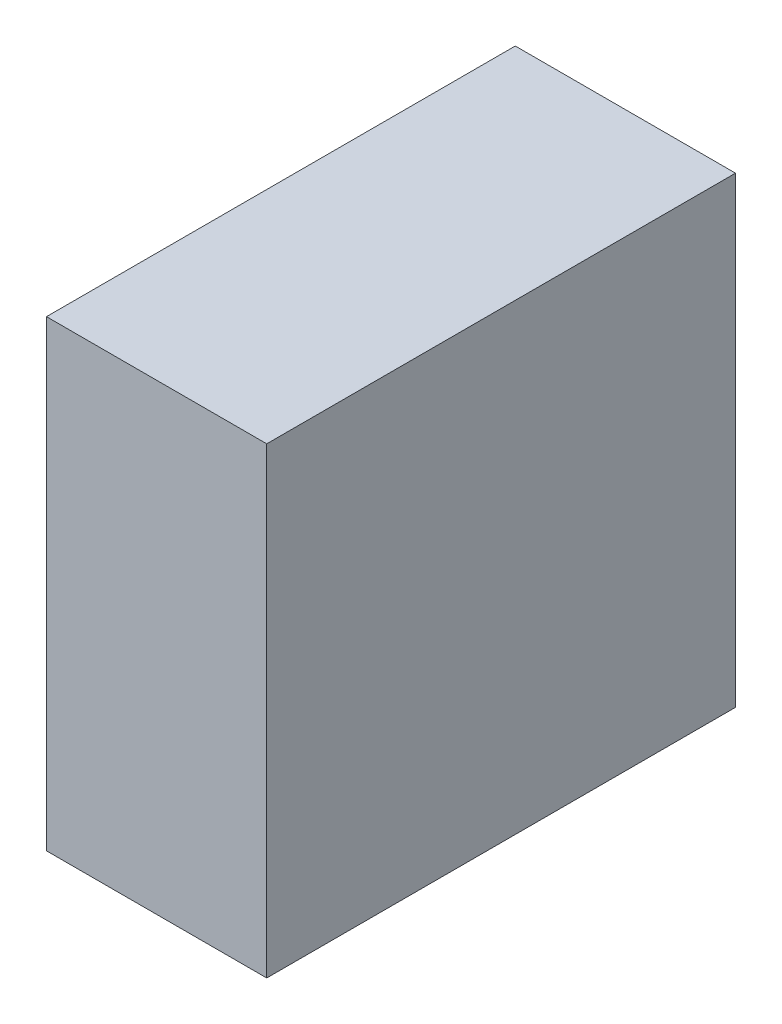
ISO-10303-21;
HEADER;
FILE_DESCRIPTION(('STEP AP214'),'2;1');
FILE_NAME('part.step','',(''),(''),'','','');
FILE_SCHEMA(('AUTOMOTIVE_DESIGN { 1 0 10303 214 1 1 1 1 }'));
ENDSEC;
DATA;
#1=APPLICATION_CONTEXT('core data for automotive mechanical design processes');
#2=APPLICATION_PROTOCOL_DEFINITION('international standard','automotive_design',2000,#1);
#3=PRODUCT_CONTEXT('',#1,'mechanical');
#4=PRODUCT('Part','Part','',(#3));
#5=PRODUCT_RELATED_PRODUCT_CATEGORY('part','',(#4));
#6=PRODUCT_DEFINITION_FORMATION('','',#4);
#7=PRODUCT_DEFINITION_CONTEXT('part definition',#1,'design');
#8=PRODUCT_DEFINITION('design','',#6,#7);
#9=PRODUCT_DEFINITION_SHAPE('','',#8);
#10=(LENGTH_UNIT() NAMED_UNIT(*) SI_UNIT(.MILLI.,.METRE.));
#11=(NAMED_UNIT(*) PLANE_ANGLE_UNIT() SI_UNIT($,.RADIAN.));
#12=(NAMED_UNIT(*) SI_UNIT($,.STERADIAN.) SOLID_ANGLE_UNIT());
#13=UNCERTAINTY_MEASURE_WITH_UNIT(LENGTH_MEASURE(1.E-05),#10,'distance_accuracy_value','');
#14=(GEOMETRIC_REPRESENTATION_CONTEXT(3) GLOBAL_UNCERTAINTY_ASSIGNED_CONTEXT((#13)) GLOBAL_UNIT_ASSIGNED_CONTEXT((#10,
#11,#12)) REPRESENTATION_CONTEXT('',''));
#15=CARTESIAN_POINT('',(0.,0.,0.));
#16=DIRECTION('',(0.,0.,1.));
#17=DIRECTION('',(1.,0.,0.));
#18=AXIS2_PLACEMENT_3D('',#15,#16,#17);
#19=CARTESIAN_POINT('',(0.,75.2,0.));
#20=DIRECTION('',(1.,0.,0.));
#21=DIRECTION('',(0.,0.,-1.));
#22=AXIS2_PLACEMENT_3D('',#19,#20,#21);
#23=PLANE('',#22);
#24=DIRECTION('',(0.,0.,1.));
#25=VECTOR('',#24,1.);
#26=CARTESIAN_POINT('',(0.,0.,0.));
#27=LINE('',#26,#25);
#28=CARTESIAN_POINT('',(0.,0.,-76.2));
#29=VERTEX_POINT('',#28);
#30=CARTESIAN_POINT('',(0.,0.,0.));
#31=VERTEX_POINT('',#30);
#32=EDGE_CURVE('E102',#29,#31,#27,.T.);
#33=ORIENTED_EDGE('',*,*,#32,.T.);
#34=DIRECTION('',(0.,-1.,0.));
#35=VECTOR('',#34,1.);
#36=CARTESIAN_POINT('',(0.,75.2,0.));
#37=LINE('',#36,#35);
#38=CARTESIAN_POINT('',(0.,75.2,0.));
#39=VERTEX_POINT('',#38);
#40=EDGE_CURVE('E11',#39,#31,#37,.T.);
#41=ORIENTED_EDGE('',*,*,#40,.F.);
#42=DIRECTION('',(0.,0.,1.));
#43=VECTOR('',#42,1.);
#44=CARTESIAN_POINT('',(0.,75.2,0.));
#45=LINE('',#44,#43);
#46=CARTESIAN_POINT('',(0.,75.2,-76.2));
#47=VERTEX_POINT('',#46);
#48=EDGE_CURVE('E90',#47,#39,#45,.T.);
#49=ORIENTED_EDGE('',*,*,#48,.F.);
#50=DIRECTION('',(0.,-1.,0.));
#51=VECTOR('',#50,1.);
#52=CARTESIAN_POINT('',(0.,75.2,-76.2));
#53=LINE('',#52,#51);
#54=EDGE_CURVE('E98',#47,#29,#53,.T.);
#55=ORIENTED_EDGE('',*,*,#54,.T.);
#56=EDGE_LOOP('',(#33,#41,#49,#55));
#57=FACE_BOUND('',#56,.T.);
#58=ADVANCED_FACE('F39',(#57),#23,.F.);
#59=CARTESIAN_POINT('',(0.,75.2,0.));
#60=DIRECTION('',(0.,0.,-1.));
#61=DIRECTION('',(-1.,0.,0.));
#62=AXIS2_PLACEMENT_3D('',#59,#60,#61);
#63=PLANE('',#62);
#64=DIRECTION('',(1.,0.,0.));
#65=VECTOR('',#64,1.);
#66=CARTESIAN_POINT('',(0.,0.,0.));
#67=LINE('',#66,#65);
#68=CARTESIAN_POINT('',(35.8,0.,0.));
#69=VERTEX_POINT('',#68);
#70=EDGE_CURVE('E94',#31,#69,#67,.T.);
#71=ORIENTED_EDGE('',*,*,#70,.T.);
#72=DIRECTION('',(0.,-1.,0.));
#73=VECTOR('',#72,1.);
#74=CARTESIAN_POINT('',(35.8,75.2,0.));
#75=LINE('',#74,#73);
#76=CARTESIAN_POINT('',(35.8,75.2,0.));
#77=VERTEX_POINT('',#76);
#78=EDGE_CURVE('E47',#77,#69,#75,.T.);
#79=ORIENTED_EDGE('',*,*,#78,.F.);
#80=DIRECTION('',(1.,0.,0.));
#81=VECTOR('',#80,1.);
#82=CARTESIAN_POINT('',(0.,75.2,0.));
#83=LINE('',#82,#81);
#84=EDGE_CURVE('E85',#39,#77,#83,.T.);
#85=ORIENTED_EDGE('',*,*,#84,.F.);
#86=ORIENTED_EDGE('',*,*,#40,.T.);
#87=EDGE_LOOP('',(#71,#79,#85,#86));
#88=FACE_BOUND('',#87,.T.);
#89=ADVANCED_FACE('F93',(#88),#63,.F.);
#90=CARTESIAN_POINT('',(35.8,75.2,0.));
#91=DIRECTION('',(-1.,0.,0.));
#92=DIRECTION('',(0.,0.,1.));
#93=AXIS2_PLACEMENT_3D('',#90,#91,#92);
#94=PLANE('',#93);
#95=DIRECTION('',(0.,0.,-1.));
#96=VECTOR('',#95,1.);
#97=CARTESIAN_POINT('',(35.8,0.,0.));
#98=LINE('',#97,#96);
#99=CARTESIAN_POINT('',(35.8,0.,-76.2));
#100=VERTEX_POINT('',#99);
#101=EDGE_CURVE('E72',#69,#100,#98,.T.);
#102=ORIENTED_EDGE('',*,*,#101,.T.);
#103=DIRECTION('',(0.,-1.,0.));
#104=VECTOR('',#103,1.);
#105=CARTESIAN_POINT('',(35.8,75.2,-76.2));
#106=LINE('',#105,#104);
#107=CARTESIAN_POINT('',(35.8,75.2,-76.2));
#108=VERTEX_POINT('',#107);
#109=EDGE_CURVE('E95',#108,#100,#106,.T.);
#110=ORIENTED_EDGE('',*,*,#109,.F.);
#111=DIRECTION('',(0.,0.,-1.));
#112=VECTOR('',#111,1.);
#113=CARTESIAN_POINT('',(35.8,75.2,0.));
#114=LINE('',#113,#112);
#115=EDGE_CURVE('E88',#77,#108,#114,.T.);
#116=ORIENTED_EDGE('',*,*,#115,.F.);
#117=ORIENTED_EDGE('',*,*,#78,.T.);
#118=EDGE_LOOP('',(#102,#110,#116,#117));
#119=FACE_BOUND('',#118,.T.);
#120=ADVANCED_FACE('F96',(#119),#94,.F.);
#121=CARTESIAN_POINT('',(0.,75.2,-76.2));
#122=DIRECTION('',(0.,0.,1.));
#123=DIRECTION('',(1.,0.,0.));
#124=AXIS2_PLACEMENT_3D('',#121,#122,#123);
#125=PLANE('',#124);
#126=DIRECTION('',(-1.,0.,0.));
#127=VECTOR('',#126,1.);
#128=CARTESIAN_POINT('',(0.,0.,-76.2));
#129=LINE('',#128,#127);
#130=EDGE_CURVE('E78',#100,#29,#129,.T.);
#131=ORIENTED_EDGE('',*,*,#130,.T.);
#132=ORIENTED_EDGE('',*,*,#54,.F.);
#133=DIRECTION('',(-1.,0.,0.));
#134=VECTOR('',#133,1.);
#135=CARTESIAN_POINT('',(0.,75.2,-76.2));
#136=LINE('',#135,#134);
#137=EDGE_CURVE('E55',#108,#47,#136,.T.);
#138=ORIENTED_EDGE('',*,*,#137,.F.);
#139=ORIENTED_EDGE('',*,*,#109,.T.);
#140=EDGE_LOOP('',(#131,#132,#138,#139));
#141=FACE_BOUND('',#140,.T.);
#142=ADVANCED_FACE('F109',(#141),#125,.F.);
#143=CARTESIAN_POINT('',(0.,75.2,0.));
#144=DIRECTION('',(0.,-1.,0.));
#145=DIRECTION('',(0.,0.,-1.));
#146=AXIS2_PLACEMENT_3D('',#143,#144,#145);
#147=PLANE('',#146);
#148=ORIENTED_EDGE('',*,*,#48,.T.);
#149=ORIENTED_EDGE('',*,*,#84,.T.);
#150=ORIENTED_EDGE('',*,*,#115,.T.);
#151=ORIENTED_EDGE('',*,*,#137,.T.);
#152=EDGE_LOOP('',(#148,#149,#150,#151));
#153=FACE_BOUND('',#152,.T.);
#154=ADVANCED_FACE('F86',(#153),#147,.F.);
#155=CARTESIAN_POINT('',(0.,0.,0.));
#156=DIRECTION('',(0.,-1.,0.));
#157=DIRECTION('',(0.,0.,-1.));
#158=AXIS2_PLACEMENT_3D('',#155,#156,#157);
#159=PLANE('',#158);
#160=ORIENTED_EDGE('',*,*,#32,.F.);
#161=ORIENTED_EDGE('',*,*,#130,.F.);
#162=ORIENTED_EDGE('',*,*,#101,.F.);
#163=ORIENTED_EDGE('',*,*,#70,.F.);
#164=EDGE_LOOP('',(#160,#161,#162,#163));
#165=FACE_BOUND('',#164,.T.);
#166=ADVANCED_FACE('F112',(#165),#159,.T.);
#167=CLOSED_SHELL('',(#58,#89,#120,#142,#154,#166));
#168=MANIFOLD_SOLID_BREP('B2',#167);
#169=ADVANCED_BREP_SHAPE_REPRESENTATION('',(#18,#168),#14);
#170=SHAPE_DEFINITION_REPRESENTATION(#9,#169);
ENDSEC;
END-ISO-10303-21;
